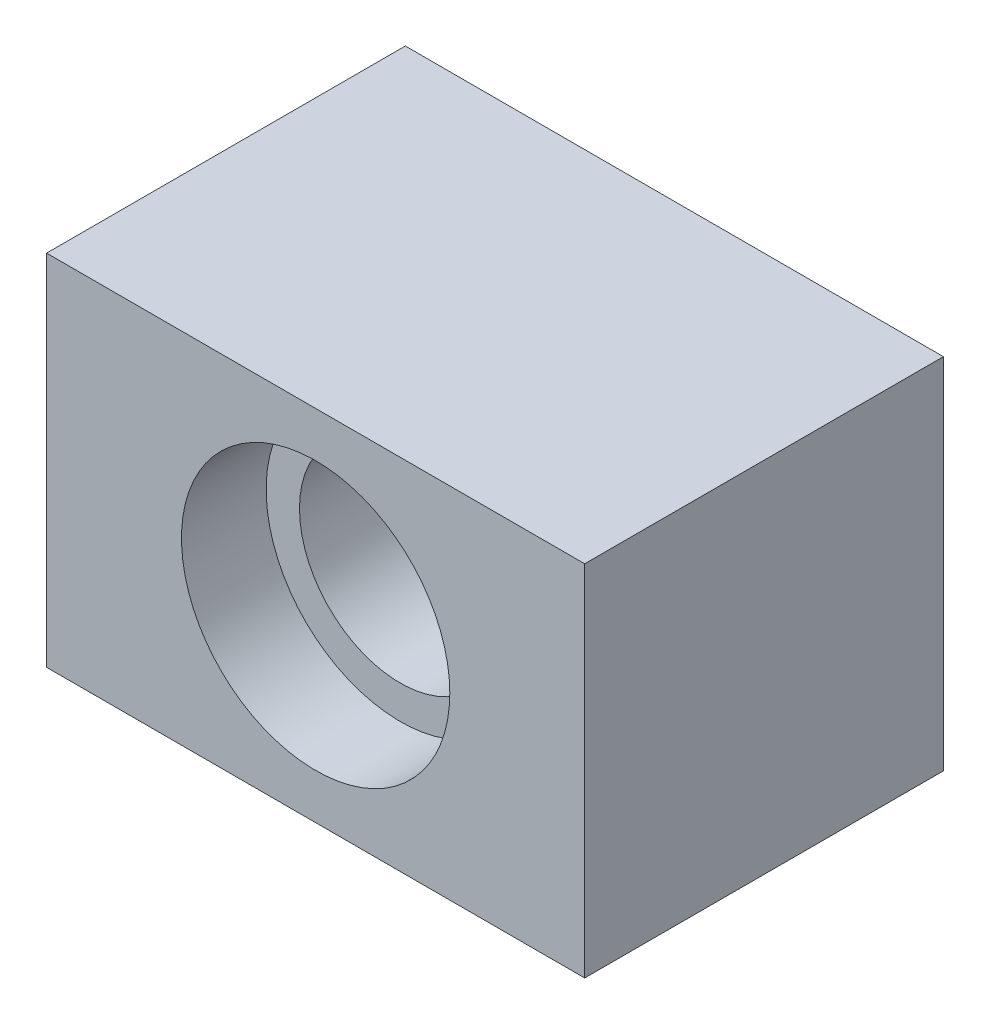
ISO-10303-21;
HEADER;
FILE_DESCRIPTION(('STEP AP214'),'2;1');
FILE_NAME('part.step','',(''),(''),'','','');
FILE_SCHEMA(('AUTOMOTIVE_DESIGN { 1 0 10303 214 1 1 1 1 }'));
ENDSEC;
DATA;
#1=APPLICATION_CONTEXT('core data for automotive mechanical design processes');
#2=APPLICATION_PROTOCOL_DEFINITION('international standard','automotive_design',2000,#1);
#3=PRODUCT_CONTEXT('',#1,'mechanical');
#4=PRODUCT('Part','Part','',(#3));
#5=PRODUCT_RELATED_PRODUCT_CATEGORY('part','',(#4));
#6=PRODUCT_DEFINITION_FORMATION('','',#4);
#7=PRODUCT_DEFINITION_CONTEXT('part definition',#1,'design');
#8=PRODUCT_DEFINITION('design','',#6,#7);
#9=PRODUCT_DEFINITION_SHAPE('','',#8);
#10=(LENGTH_UNIT() NAMED_UNIT(*) SI_UNIT(.MILLI.,.METRE.));
#11=(NAMED_UNIT(*) PLANE_ANGLE_UNIT() SI_UNIT($,.RADIAN.));
#12=(NAMED_UNIT(*) SI_UNIT($,.STERADIAN.) SOLID_ANGLE_UNIT());
#13=UNCERTAINTY_MEASURE_WITH_UNIT(LENGTH_MEASURE(1.E-05),#10,'distance_accuracy_value','');
#14=(GEOMETRIC_REPRESENTATION_CONTEXT(3) GLOBAL_UNCERTAINTY_ASSIGNED_CONTEXT((#13)) GLOBAL_UNIT_ASSIGNED_CONTEXT((#10,
#11,#12)) REPRESENTATION_CONTEXT('',''));
#15=CARTESIAN_POINT('',(0.,0.,0.));
#16=DIRECTION('',(0.,0.,1.));
#17=DIRECTION('',(1.,0.,0.));
#18=AXIS2_PLACEMENT_3D('',#15,#16,#17);
#19=CARTESIAN_POINT('',(0.,0.,-12.7));
#20=DIRECTION('',(0.,0.,1.));
#21=DIRECTION('',(1.,0.,0.));
#22=AXIS2_PLACEMENT_3D('',#19,#20,#21);
#23=PLANE('',#22);
#24=CARTESIAN_POINT('',(-14.2748,-6.35,-12.7));
#25=DIRECTION('',(0.,0.,1.));
#26=DIRECTION('',(1.,0.,0.));
#27=AXIS2_PLACEMENT_3D('',#24,#25,#26);
#28=CIRCLE('',#27,3.175);
#29=CARTESIAN_POINT('',(-11.0998,-6.35,-12.7));
#30=VERTEX_POINT('',#29);
#31=EDGE_CURVE('E116',#30,#30,#28,.F.);
#32=ORIENTED_EDGE('',*,*,#31,.F.);
#33=EDGE_LOOP('',(#32));
#34=FACE_BOUND('',#33,.T.);
#35=DIRECTION('',(0.,-1.,0.));
#36=VECTOR('',#35,1.);
#37=CARTESIAN_POINT('',(-19.05,12.7,-12.7));
#38=LINE('',#37,#36);
#39=CARTESIAN_POINT('',(-19.05,12.7,-12.7));
#40=VERTEX_POINT('',#39);
#41=CARTESIAN_POINT('',(-19.05,-12.7,-12.7));
#42=VERTEX_POINT('',#41);
#43=EDGE_CURVE('E100',#40,#42,#38,.T.);
#44=ORIENTED_EDGE('',*,*,#43,.F.);
#45=DIRECTION('',(-1.,0.,0.));
#46=VECTOR('',#45,1.);
#47=CARTESIAN_POINT('',(19.05,12.7,-12.7));
#48=LINE('',#47,#46);
#49=CARTESIAN_POINT('',(19.05,12.7,-12.7));
#50=VERTEX_POINT('',#49);
#51=EDGE_CURVE('E75',#50,#40,#48,.T.);
#52=ORIENTED_EDGE('',*,*,#51,.F.);
#53=DIRECTION('',(0.,1.,0.));
#54=VECTOR('',#53,1.);
#55=CARTESIAN_POINT('',(19.05,-12.7,-12.7));
#56=LINE('',#55,#54);
#57=CARTESIAN_POINT('',(19.05,-12.7,-12.7));
#58=VERTEX_POINT('',#57);
#59=EDGE_CURVE('E69',#58,#50,#56,.T.);
#60=ORIENTED_EDGE('',*,*,#59,.F.);
#61=DIRECTION('',(1.,0.,0.));
#62=VECTOR('',#61,1.);
#63=CARTESIAN_POINT('',(-19.05,-12.7,-12.7));
#64=LINE('',#63,#62);
#65=EDGE_CURVE('E91',#42,#58,#64,.T.);
#66=ORIENTED_EDGE('',*,*,#65,.F.);
#67=EDGE_LOOP('',(#44,#52,#60,#66));
#68=FACE_BOUND('',#67,.T.);
#69=CARTESIAN_POINT('',(0.,0.,-12.7));
#70=DIRECTION('',(0.,0.,1.));
#71=DIRECTION('',(1.,0.,0.));
#72=AXIS2_PLACEMENT_3D('',#69,#70,#71);
#73=CIRCLE('',#72,9.5);
#74=CARTESIAN_POINT('',(-9.5,0.,-12.7));
#75=VERTEX_POINT('',#74);
#76=EDGE_CURVE('E118',#75,#75,#73,.T.);
#77=ORIENTED_EDGE('',*,*,#76,.T.);
#78=EDGE_LOOP('',(#77));
#79=FACE_BOUND('',#78,.T.);
#80=CARTESIAN_POINT('',(14.2748,6.35,-12.7));
#81=DIRECTION('',(0.,0.,1.));
#82=DIRECTION('',(1.,0.,0.));
#83=AXIS2_PLACEMENT_3D('',#80,#81,#82);
#84=CIRCLE('',#83,3.175);
#85=CARTESIAN_POINT('',(17.4498,6.35,-12.7));
#86=VERTEX_POINT('',#85);
#87=EDGE_CURVE('E37',#86,#86,#84,.F.);
#88=ORIENTED_EDGE('',*,*,#87,.F.);
#89=EDGE_LOOP('',(#88));
#90=FACE_BOUND('',#89,.T.);
#91=ADVANCED_FACE('F33',(#34,#68,#79,#90),#23,.F.);
#92=CARTESIAN_POINT('',(0.,0.,12.7));
#93=DIRECTION('',(0.,0.,-1.));
#94=DIRECTION('',(-1.,0.,0.));
#95=AXIS2_PLACEMENT_3D('',#92,#93,#94);
#96=CYLINDRICAL_SURFACE('',#95,7.1374);
#97=CARTESIAN_POINT('',(0.,0.,-6.7056));
#98=DIRECTION('',(0.,0.,1.));
#99=DIRECTION('',(1.,0.,0.));
#100=AXIS2_PLACEMENT_3D('',#97,#98,#99);
#101=CIRCLE('',#100,7.1374);
#102=CARTESIAN_POINT('',(7.1374,0.,-6.7056));
#103=VERTEX_POINT('',#102);
#104=EDGE_CURVE('E112',#103,#103,#101,.T.);
#105=ORIENTED_EDGE('',*,*,#104,.F.);
#106=EDGE_LOOP('',(#105));
#107=FACE_BOUND('',#106,.T.);
#108=CARTESIAN_POINT('',(0.,0.,6.7056));
#109=DIRECTION('',(0.,0.,1.));
#110=DIRECTION('',(1.,0.,0.));
#111=AXIS2_PLACEMENT_3D('',#108,#109,#110);
#112=CIRCLE('',#111,7.1374);
#113=CARTESIAN_POINT('',(7.1374,0.,6.7056));
#114=VERTEX_POINT('',#113);
#115=EDGE_CURVE('E103',#114,#114,#112,.T.);
#116=ORIENTED_EDGE('',*,*,#115,.T.);
#117=EDGE_LOOP('',(#116));
#118=FACE_BOUND('',#117,.T.);
#119=ADVANCED_FACE('F142',(#107,#118),#96,.F.);
#120=CARTESIAN_POINT('',(0.,0.,12.7));
#121=DIRECTION('',(0.,0.,1.));
#122=DIRECTION('',(1.,0.,0.));
#123=AXIS2_PLACEMENT_3D('',#120,#121,#122);
#124=PLANE('',#123);
#125=CARTESIAN_POINT('',(0.,0.,12.7));
#126=DIRECTION('',(0.,0.,1.));
#127=DIRECTION('',(1.,0.,0.));
#128=AXIS2_PLACEMENT_3D('',#125,#126,#127);
#129=CIRCLE('',#128,9.5);
#130=CARTESIAN_POINT('',(9.5,0.,12.7));
#131=VERTEX_POINT('',#130);
#132=EDGE_CURVE('E114',#131,#131,#129,.T.);
#133=ORIENTED_EDGE('',*,*,#132,.F.);
#134=EDGE_LOOP('',(#133));
#135=FACE_BOUND('',#134,.T.);
#136=DIRECTION('',(0.,-1.,0.));
#137=VECTOR('',#136,1.);
#138=CARTESIAN_POINT('',(-19.05,12.7,12.7));
#139=LINE('',#138,#137);
#140=CARTESIAN_POINT('',(-19.05,12.7,12.7));
#141=VERTEX_POINT('',#140);
#142=CARTESIAN_POINT('',(-19.05,-12.7,12.7));
#143=VERTEX_POINT('',#142);
#144=EDGE_CURVE('E87',#141,#143,#139,.T.);
#145=ORIENTED_EDGE('',*,*,#144,.T.);
#146=DIRECTION('',(1.,0.,0.));
#147=VECTOR('',#146,1.);
#148=CARTESIAN_POINT('',(-19.05,-12.7,12.7));
#149=LINE('',#148,#147);
#150=CARTESIAN_POINT('',(19.05,-12.7,12.7));
#151=VERTEX_POINT('',#150);
#152=EDGE_CURVE('E82',#143,#151,#149,.T.);
#153=ORIENTED_EDGE('',*,*,#152,.T.);
#154=DIRECTION('',(0.,1.,0.));
#155=VECTOR('',#154,1.);
#156=CARTESIAN_POINT('',(19.05,-12.7,12.7));
#157=LINE('',#156,#155);
#158=CARTESIAN_POINT('',(19.05,12.7,12.7));
#159=VERTEX_POINT('',#158);
#160=EDGE_CURVE('E85',#151,#159,#157,.T.);
#161=ORIENTED_EDGE('',*,*,#160,.T.);
#162=DIRECTION('',(-1.,0.,0.));
#163=VECTOR('',#162,1.);
#164=CARTESIAN_POINT('',(19.05,12.7,12.7));
#165=LINE('',#164,#163);
#166=EDGE_CURVE('E52',#159,#141,#165,.T.);
#167=ORIENTED_EDGE('',*,*,#166,.T.);
#168=EDGE_LOOP('',(#145,#153,#161,#167));
#169=FACE_BOUND('',#168,.T.);
#170=ADVANCED_FACE('F83',(#135,#169),#124,.T.);
#171=CARTESIAN_POINT('',(-19.05,12.7,12.7));
#172=DIRECTION('',(1.,0.,0.));
#173=DIRECTION('',(0.,0.,-1.));
#174=AXIS2_PLACEMENT_3D('',#171,#172,#173);
#175=PLANE('',#174);
#176=ORIENTED_EDGE('',*,*,#43,.T.);
#177=DIRECTION('',(0.,0.,-1.));
#178=VECTOR('',#177,1.);
#179=CARTESIAN_POINT('',(-19.05,-12.7,12.7));
#180=LINE('',#179,#178);
#181=EDGE_CURVE('E11',#143,#42,#180,.T.);
#182=ORIENTED_EDGE('',*,*,#181,.F.);
#183=ORIENTED_EDGE('',*,*,#144,.F.);
#184=DIRECTION('',(0.,0.,-1.));
#185=VECTOR('',#184,1.);
#186=CARTESIAN_POINT('',(-19.05,12.7,12.7));
#187=LINE('',#186,#185);
#188=EDGE_CURVE('E96',#141,#40,#187,.T.);
#189=ORIENTED_EDGE('',*,*,#188,.T.);
#190=EDGE_LOOP('',(#176,#182,#183,#189));
#191=FACE_BOUND('',#190,.T.);
#192=ADVANCED_FACE('F35',(#191),#175,.F.);
#193=CARTESIAN_POINT('',(-19.05,-12.7,12.7));
#194=DIRECTION('',(0.,1.,0.));
#195=DIRECTION('',(0.,0.,1.));
#196=AXIS2_PLACEMENT_3D('',#193,#194,#195);
#197=PLANE('',#196);
#198=ORIENTED_EDGE('',*,*,#65,.T.);
#199=DIRECTION('',(0.,0.,-1.));
#200=VECTOR('',#199,1.);
#201=CARTESIAN_POINT('',(19.05,-12.7,12.7));
#202=LINE('',#201,#200);
#203=EDGE_CURVE('E43',#151,#58,#202,.T.);
#204=ORIENTED_EDGE('',*,*,#203,.F.);
#205=ORIENTED_EDGE('',*,*,#152,.F.);
#206=ORIENTED_EDGE('',*,*,#181,.T.);
#207=EDGE_LOOP('',(#198,#204,#205,#206));
#208=FACE_BOUND('',#207,.T.);
#209=ADVANCED_FACE('F90',(#208),#197,.F.);
#210=CARTESIAN_POINT('',(19.05,-12.7,12.7));
#211=DIRECTION('',(-1.,0.,0.));
#212=DIRECTION('',(0.,0.,1.));
#213=AXIS2_PLACEMENT_3D('',#210,#211,#212);
#214=PLANE('',#213);
#215=ORIENTED_EDGE('',*,*,#59,.T.);
#216=DIRECTION('',(0.,0.,-1.));
#217=VECTOR('',#216,1.);
#218=CARTESIAN_POINT('',(19.05,12.7,12.7));
#219=LINE('',#218,#217);
#220=EDGE_CURVE('E92',#159,#50,#219,.T.);
#221=ORIENTED_EDGE('',*,*,#220,.F.);
#222=ORIENTED_EDGE('',*,*,#160,.F.);
#223=ORIENTED_EDGE('',*,*,#203,.T.);
#224=EDGE_LOOP('',(#215,#221,#222,#223));
#225=FACE_BOUND('',#224,.T.);
#226=ADVANCED_FACE('F94',(#225),#214,.F.);
#227=CARTESIAN_POINT('',(19.05,12.7,12.7));
#228=DIRECTION('',(0.,-1.,0.));
#229=DIRECTION('',(1.,0.,0.));
#230=AXIS2_PLACEMENT_3D('',#227,#228,#229);
#231=PLANE('',#230);
#232=ORIENTED_EDGE('',*,*,#51,.T.);
#233=ORIENTED_EDGE('',*,*,#188,.F.);
#234=ORIENTED_EDGE('',*,*,#166,.F.);
#235=ORIENTED_EDGE('',*,*,#220,.T.);
#236=EDGE_LOOP('',(#232,#233,#234,#235));
#237=FACE_BOUND('',#236,.T.);
#238=ADVANCED_FACE('F158',(#237),#231,.F.);
#239=CARTESIAN_POINT('',(0.,0.,6.7056));
#240=DIRECTION('',(0.,0.,1.));
#241=DIRECTION('',(1.,0.,0.));
#242=AXIS2_PLACEMENT_3D('',#239,#240,#241);
#243=CYLINDRICAL_SURFACE('',#242,9.5);
#244=CARTESIAN_POINT('',(0.,0.,6.7056));
#245=DIRECTION('',(0.,0.,1.));
#246=DIRECTION('',(1.,0.,0.));
#247=AXIS2_PLACEMENT_3D('',#244,#245,#246);
#248=CIRCLE('',#247,9.5);
#249=CARTESIAN_POINT('',(9.5,0.,6.7056));
#250=VERTEX_POINT('',#249);
#251=EDGE_CURVE('E111',#250,#250,#248,.T.);
#252=CARTESIAN_POINT('',(9.5,0.,6.7056));
#253=CARTESIAN_POINT('',(9.5,0.,6.76804166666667));
#254=CARTESIAN_POINT('',(9.5,0.,6.83048333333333));
#255=CARTESIAN_POINT('',(9.5,0.,6.95536666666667));
#256=CARTESIAN_POINT('',(9.5,0.,7.01780833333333));
#257=CARTESIAN_POINT('',(9.5,0.,7.14269166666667));
#258=CARTESIAN_POINT('',(9.5,0.,7.20513333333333));
#259=CARTESIAN_POINT('',(9.5,0.,7.33001666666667));
#260=CARTESIAN_POINT('',(9.5,0.,7.39245833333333));
#261=CARTESIAN_POINT('',(9.5,0.,7.51734166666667));
#262=CARTESIAN_POINT('',(9.5,0.,7.57978333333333));
#263=CARTESIAN_POINT('',(9.5,0.,7.70466666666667));
#264=CARTESIAN_POINT('',(9.5,0.,7.76710833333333));
#265=CARTESIAN_POINT('',(9.5,0.,7.89199166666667));
#266=CARTESIAN_POINT('',(9.5,0.,7.95443333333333));
#267=CARTESIAN_POINT('',(9.5,0.,8.07931666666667));
#268=CARTESIAN_POINT('',(9.5,0.,8.14175833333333));
#269=CARTESIAN_POINT('',(9.5,0.,8.26664166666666));
#270=CARTESIAN_POINT('',(9.5,0.,8.32908333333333));
#271=CARTESIAN_POINT('',(9.5,0.,8.45396666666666));
#272=CARTESIAN_POINT('',(9.5,0.,8.51640833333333));
#273=CARTESIAN_POINT('',(9.5,0.,8.64129166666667));
#274=CARTESIAN_POINT('',(9.5,0.,8.70373333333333));
#275=CARTESIAN_POINT('',(9.5,0.,8.82861666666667));
#276=CARTESIAN_POINT('',(9.5,0.,8.89105833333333));
#277=CARTESIAN_POINT('',(9.5,0.,9.01594166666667));
#278=CARTESIAN_POINT('',(9.5,0.,9.07838333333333));
#279=CARTESIAN_POINT('',(9.5,0.,9.20326666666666));
#280=CARTESIAN_POINT('',(9.5,0.,9.26570833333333));
#281=CARTESIAN_POINT('',(9.5,0.,9.39059166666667));
#282=CARTESIAN_POINT('',(9.5,0.,9.45303333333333));
#283=CARTESIAN_POINT('',(9.5,0.,9.57791666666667));
#284=CARTESIAN_POINT('',(9.5,0.,9.64035833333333));
#285=CARTESIAN_POINT('',(9.5,0.,9.76524166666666));
#286=CARTESIAN_POINT('',(9.5,0.,9.82768333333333));
#287=CARTESIAN_POINT('',(9.5,0.,9.95256666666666));
#288=CARTESIAN_POINT('',(9.5,0.,10.0150083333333));
#289=CARTESIAN_POINT('',(9.5,0.,10.1398916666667));
#290=CARTESIAN_POINT('',(9.5,0.,10.2023333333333));
#291=CARTESIAN_POINT('',(9.5,0.,10.3272166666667));
#292=CARTESIAN_POINT('',(9.5,0.,10.3896583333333));
#293=CARTESIAN_POINT('',(9.5,0.,10.5145416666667));
#294=CARTESIAN_POINT('',(9.5,0.,10.5769833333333));
#295=CARTESIAN_POINT('',(9.5,0.,10.7018666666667));
#296=CARTESIAN_POINT('',(9.5,0.,10.7643083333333));
#297=CARTESIAN_POINT('',(9.5,0.,10.8891916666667));
#298=CARTESIAN_POINT('',(9.5,0.,10.9516333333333));
#299=CARTESIAN_POINT('',(9.5,0.,11.0765166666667));
#300=CARTESIAN_POINT('',(9.5,0.,11.1389583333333));
#301=CARTESIAN_POINT('',(9.5,0.,11.2638416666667));
#302=CARTESIAN_POINT('',(9.5,0.,11.3262833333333));
#303=CARTESIAN_POINT('',(9.5,0.,11.4511666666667));
#304=CARTESIAN_POINT('',(9.5,0.,11.5136083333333));
#305=CARTESIAN_POINT('',(9.5,0.,11.6384916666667));
#306=CARTESIAN_POINT('',(9.5,0.,11.7009333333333));
#307=CARTESIAN_POINT('',(9.5,0.,11.8258166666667));
#308=CARTESIAN_POINT('',(9.5,0.,11.8882583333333));
#309=CARTESIAN_POINT('',(9.5,0.,12.0131416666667));
#310=CARTESIAN_POINT('',(9.5,0.,12.0755833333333));
#311=CARTESIAN_POINT('',(9.5,0.,12.2004666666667));
#312=CARTESIAN_POINT('',(9.5,0.,12.2629083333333));
#313=CARTESIAN_POINT('',(9.5,0.,12.3877916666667));
#314=CARTESIAN_POINT('',(9.5,0.,12.4502333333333));
#315=CARTESIAN_POINT('',(9.5,0.,12.5751166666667));
#316=CARTESIAN_POINT('',(9.5,0.,12.6375583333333));
#317=CARTESIAN_POINT('',(9.5,0.,12.7));
#318=B_SPLINE_CURVE_WITH_KNOTS('',3,(#252,#253,#254,#255,#256,#257,#258,#259,#260,#261,#262,
#263,#264,#265,#266,#267,#268,#269,#270,#271,#272,#273,#274,#275,#276,#277,#278,#279,#280,#281,
#282,#283,#284,#285,#286,#287,#288,#289,#290,#291,#292,#293,#294,#295,#296,#297,#298,#299,#300,
#301,#302,#303,#304,#305,#306,#307,#308,#309,#310,#311,#312,#313,#314,#315,#316,#317),
.UNSPECIFIED.,.F.,.F.,(4,2,2,2,2,2,2,2,2,2,2,2,2,2,2,2,2,2,2,2,2,2,2,2,2,2,2,2,2,2,2,2,4),(0.,
0.187324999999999,0.37465,0.561974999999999,0.7493,0.936624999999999,1.12395,1.311275,1.4986,
1.685925,1.87325,2.060575,2.2479,2.435225,2.62255,2.809875,2.9972,3.184525,3.37185,3.559175,
3.7465,3.933825,4.12115,4.308475,4.4958,4.683125,4.87045,5.057775,5.2451,5.432425,5.61975,
5.807075,5.9944),.UNSPECIFIED.);
#319=EDGE_CURVE('BSEAM139',#250,#131,#318,.T.);
#320=ORIENTED_EDGE('',*,*,#251,.F.);
#321=ORIENTED_EDGE('',*,*,#132,.T.);
#322=ORIENTED_EDGE('',*,*,#319,.T.);
#323=ORIENTED_EDGE('',*,*,#319,.F.);
#324=EDGE_LOOP('',(#320,#322,#321,#323));
#325=FACE_BOUND('',#324,.T.);
#326=ADVANCED_FACE('F139',(#325),#243,.F.);
#327=CARTESIAN_POINT('',(0.,0.,6.7056));
#328=DIRECTION('',(0.,0.,1.));
#329=DIRECTION('',(1.,0.,0.));
#330=AXIS2_PLACEMENT_3D('',#327,#328,#329);
#331=PLANE('',#330);
#332=ORIENTED_EDGE('',*,*,#115,.F.);
#333=EDGE_LOOP('',(#332));
#334=FACE_BOUND('',#333,.T.);
#335=ORIENTED_EDGE('',*,*,#251,.T.);
#336=EDGE_LOOP('',(#335));
#337=FACE_BOUND('',#336,.T.);
#338=ADVANCED_FACE('F181',(#334,#337),#331,.T.);
#339=CARTESIAN_POINT('',(0.,0.,-6.7056));
#340=DIRECTION('',(0.,0.,-1.));
#341=DIRECTION('',(-1.,0.,0.));
#342=AXIS2_PLACEMENT_3D('',#339,#340,#341);
#343=CYLINDRICAL_SURFACE('',#342,9.5);
#344=CARTESIAN_POINT('',(0.,0.,-6.7056));
#345=DIRECTION('',(0.,0.,1.));
#346=DIRECTION('',(1.,0.,0.));
#347=AXIS2_PLACEMENT_3D('',#344,#345,#346);
#348=CIRCLE('',#347,9.5);
#349=CARTESIAN_POINT('',(-9.5,0.,-6.7056));
#350=VERTEX_POINT('',#349);
#351=EDGE_CURVE('E115',#350,#350,#348,.T.);
#352=CARTESIAN_POINT('',(-9.5,0.,-6.7056));
#353=CARTESIAN_POINT('',(-9.5,0.,-6.76804166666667));
#354=CARTESIAN_POINT('',(-9.5,0.,-6.83048333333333));
#355=CARTESIAN_POINT('',(-9.5,0.,-6.95536666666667));
#356=CARTESIAN_POINT('',(-9.5,0.,-7.01780833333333));
#357=CARTESIAN_POINT('',(-9.5,0.,-7.14269166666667));
#358=CARTESIAN_POINT('',(-9.5,0.,-7.20513333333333));
#359=CARTESIAN_POINT('',(-9.5,0.,-7.33001666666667));
#360=CARTESIAN_POINT('',(-9.5,0.,-7.39245833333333));
#361=CARTESIAN_POINT('',(-9.5,0.,-7.51734166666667));
#362=CARTESIAN_POINT('',(-9.5,0.,-7.57978333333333));
#363=CARTESIAN_POINT('',(-9.5,0.,-7.70466666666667));
#364=CARTESIAN_POINT('',(-9.5,0.,-7.76710833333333));
#365=CARTESIAN_POINT('',(-9.5,0.,-7.89199166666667));
#366=CARTESIAN_POINT('',(-9.5,0.,-7.95443333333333));
#367=CARTESIAN_POINT('',(-9.5,0.,-8.07931666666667));
#368=CARTESIAN_POINT('',(-9.5,0.,-8.14175833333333));
#369=CARTESIAN_POINT('',(-9.5,0.,-8.26664166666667));
#370=CARTESIAN_POINT('',(-9.5,0.,-8.32908333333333));
#371=CARTESIAN_POINT('',(-9.5,0.,-8.45396666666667));
#372=CARTESIAN_POINT('',(-9.5,0.,-8.51640833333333));
#373=CARTESIAN_POINT('',(-9.5,0.,-8.64129166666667));
#374=CARTESIAN_POINT('',(-9.5,0.,-8.70373333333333));
#375=CARTESIAN_POINT('',(-9.5,0.,-8.82861666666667));
#376=CARTESIAN_POINT('',(-9.5,0.,-8.89105833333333));
#377=CARTESIAN_POINT('',(-9.5,0.,-9.01594166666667));
#378=CARTESIAN_POINT('',(-9.5,0.,-9.07838333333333));
#379=CARTESIAN_POINT('',(-9.5,0.,-9.20326666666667));
#380=CARTESIAN_POINT('',(-9.5,0.,-9.26570833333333));
#381=CARTESIAN_POINT('',(-9.5,0.,-9.39059166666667));
#382=CARTESIAN_POINT('',(-9.5,0.,-9.45303333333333));
#383=CARTESIAN_POINT('',(-9.5,0.,-9.57791666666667));
#384=CARTESIAN_POINT('',(-9.5,0.,-9.64035833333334));
#385=CARTESIAN_POINT('',(-9.5,0.,-9.76524166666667));
#386=CARTESIAN_POINT('',(-9.5,0.,-9.82768333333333));
#387=CARTESIAN_POINT('',(-9.5,0.,-9.95256666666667));
#388=CARTESIAN_POINT('',(-9.5,0.,-10.0150083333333));
#389=CARTESIAN_POINT('',(-9.5,0.,-10.1398916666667));
#390=CARTESIAN_POINT('',(-9.5,0.,-10.2023333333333));
#391=CARTESIAN_POINT('',(-9.5,0.,-10.3272166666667));
#392=CARTESIAN_POINT('',(-9.5,0.,-10.3896583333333));
#393=CARTESIAN_POINT('',(-9.5,0.,-10.5145416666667));
#394=CARTESIAN_POINT('',(-9.5,0.,-10.5769833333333));
#395=CARTESIAN_POINT('',(-9.5,0.,-10.7018666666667));
#396=CARTESIAN_POINT('',(-9.5,0.,-10.7643083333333));
#397=CARTESIAN_POINT('',(-9.5,0.,-10.8891916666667));
#398=CARTESIAN_POINT('',(-9.5,0.,-10.9516333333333));
#399=CARTESIAN_POINT('',(-9.5,0.,-11.0765166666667));
#400=CARTESIAN_POINT('',(-9.5,0.,-11.1389583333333));
#401=CARTESIAN_POINT('',(-9.5,0.,-11.2638416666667));
#402=CARTESIAN_POINT('',(-9.5,0.,-11.3262833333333));
#403=CARTESIAN_POINT('',(-9.5,0.,-11.4511666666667));
#404=CARTESIAN_POINT('',(-9.5,0.,-11.5136083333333));
#405=CARTESIAN_POINT('',(-9.5,0.,-11.6384916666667));
#406=CARTESIAN_POINT('',(-9.5,0.,-11.7009333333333));
#407=CARTESIAN_POINT('',(-9.5,0.,-11.8258166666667));
#408=CARTESIAN_POINT('',(-9.5,0.,-11.8882583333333));
#409=CARTESIAN_POINT('',(-9.5,0.,-12.0131416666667));
#410=CARTESIAN_POINT('',(-9.5,0.,-12.0755833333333));
#411=CARTESIAN_POINT('',(-9.5,0.,-12.2004666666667));
#412=CARTESIAN_POINT('',(-9.5,0.,-12.2629083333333));
#413=CARTESIAN_POINT('',(-9.5,0.,-12.3877916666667));
#414=CARTESIAN_POINT('',(-9.5,0.,-12.4502333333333));
#415=CARTESIAN_POINT('',(-9.5,0.,-12.5751166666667));
#416=CARTESIAN_POINT('',(-9.5,0.,-12.6375583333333));
#417=CARTESIAN_POINT('',(-9.5,0.,-12.7));
#418=B_SPLINE_CURVE_WITH_KNOTS('',3,(#352,#353,#354,#355,#356,#357,#358,#359,#360,#361,#362,
#363,#364,#365,#366,#367,#368,#369,#370,#371,#372,#373,#374,#375,#376,#377,#378,#379,#380,#381,
#382,#383,#384,#385,#386,#387,#388,#389,#390,#391,#392,#393,#394,#395,#396,#397,#398,#399,#400,
#401,#402,#403,#404,#405,#406,#407,#408,#409,#410,#411,#412,#413,#414,#415,#416,#417),
.UNSPECIFIED.,.F.,.F.,(4,2,2,2,2,2,2,2,2,2,2,2,2,2,2,2,2,2,2,2,2,2,2,2,2,2,2,2,2,2,2,2,4),(0.,
0.187325,0.374650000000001,0.561975,0.749300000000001,0.936625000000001,1.12395,1.311275,1.4986,
1.685925,1.87325,2.060575,2.2479,2.435225,2.62255,2.809875,2.9972,3.184525,3.37185,3.559175,
3.7465,3.933825,4.12115,4.308475,4.4958,4.683125,4.87045,5.057775,5.2451,5.432425,5.61975,
5.807075,5.9944),.UNSPECIFIED.);
#419=EDGE_CURVE('BSEAM189',#350,#75,#418,.T.);
#420=ORIENTED_EDGE('',*,*,#351,.T.);
#421=ORIENTED_EDGE('',*,*,#76,.F.);
#422=ORIENTED_EDGE('',*,*,#419,.T.);
#423=ORIENTED_EDGE('',*,*,#419,.F.);
#424=EDGE_LOOP('',(#420,#422,#421,#423));
#425=FACE_BOUND('',#424,.T.);
#426=ADVANCED_FACE('F189',(#425),#343,.F.);
#427=CARTESIAN_POINT('',(0.,0.,-6.7056));
#428=DIRECTION('',(0.,0.,1.));
#429=DIRECTION('',(1.,0.,0.));
#430=AXIS2_PLACEMENT_3D('',#427,#428,#429);
#431=PLANE('',#430);
#432=ORIENTED_EDGE('',*,*,#104,.T.);
#433=EDGE_LOOP('',(#432));
#434=FACE_BOUND('',#433,.T.);
#435=ORIENTED_EDGE('',*,*,#351,.F.);
#436=EDGE_LOOP('',(#435));
#437=FACE_BOUND('',#436,.T.);
#438=ADVANCED_FACE('F198',(#434,#437),#431,.F.);
#439=CARTESIAN_POINT('',(-14.2748,-6.35,2.54));
#440=DIRECTION('',(0.,0.,-1.));
#441=DIRECTION('',(-1.,0.,0.));
#442=AXIS2_PLACEMENT_3D('',#439,#440,#441);
#443=CYLINDRICAL_SURFACE('',#442,3.175);
#444=CARTESIAN_POINT('',(-14.2748,-6.35,2.54));
#445=DIRECTION('',(0.,0.,1.));
#446=DIRECTION('',(1.,0.,0.));
#447=AXIS2_PLACEMENT_3D('',#444,#445,#446);
#448=CIRCLE('',#447,3.175);
#449=CARTESIAN_POINT('',(-11.0998,-6.35,2.54));
#450=VERTEX_POINT('',#449);
#451=EDGE_CURVE('E119',#450,#450,#448,.T.);
#452=ORIENTED_EDGE('',*,*,#451,.T.);
#453=EDGE_LOOP('',(#452));
#454=FACE_BOUND('',#453,.T.);
#455=ORIENTED_EDGE('',*,*,#31,.T.);
#456=EDGE_LOOP('',(#455));
#457=FACE_BOUND('',#456,.T.);
#458=ADVANCED_FACE('F206',(#454,#457),#443,.F.);
#459=CARTESIAN_POINT('',(-14.2748,-6.35,2.54));
#460=DIRECTION('',(0.,0.,1.));
#461=DIRECTION('',(1.,0.,0.));
#462=AXIS2_PLACEMENT_3D('',#459,#460,#461);
#463=PLANE('',#462);
#464=ORIENTED_EDGE('',*,*,#451,.F.);
#465=EDGE_LOOP('',(#464));
#466=FACE_BOUND('',#465,.T.);
#467=ADVANCED_FACE('F214',(#466),#463,.F.);
#468=CARTESIAN_POINT('',(14.2748,6.35,2.54));
#469=DIRECTION('',(0.,0.,-1.));
#470=DIRECTION('',(-1.,0.,0.));
#471=AXIS2_PLACEMENT_3D('',#468,#469,#470);
#472=CYLINDRICAL_SURFACE('',#471,3.175);
#473=CARTESIAN_POINT('',(14.2748,6.35,2.54));
#474=DIRECTION('',(0.,0.,1.));
#475=DIRECTION('',(1.,0.,0.));
#476=AXIS2_PLACEMENT_3D('',#473,#474,#475);
#477=CIRCLE('',#476,3.175);
#478=CARTESIAN_POINT('',(17.4498,6.35,2.54));
#479=VERTEX_POINT('',#478);
#480=EDGE_CURVE('E129',#479,#479,#477,.T.);
#481=ORIENTED_EDGE('',*,*,#480,.T.);
#482=EDGE_LOOP('',(#481));
#483=FACE_BOUND('',#482,.T.);
#484=ORIENTED_EDGE('',*,*,#87,.T.);
#485=EDGE_LOOP('',(#484));
#486=FACE_BOUND('',#485,.T.);
#487=ADVANCED_FACE('F221',(#483,#486),#472,.F.);
#488=CARTESIAN_POINT('',(14.2748,6.35,2.54));
#489=DIRECTION('',(0.,0.,1.));
#490=DIRECTION('',(1.,0.,0.));
#491=AXIS2_PLACEMENT_3D('',#488,#489,#490);
#492=PLANE('',#491);
#493=ORIENTED_EDGE('',*,*,#480,.F.);
#494=EDGE_LOOP('',(#493));
#495=FACE_BOUND('',#494,.T.);
#496=ADVANCED_FACE('F229',(#495),#492,.F.);
#497=CLOSED_SHELL('',(#91,#119,#170,#192,#209,#226,#238,#326,#338,#426,#438,#458,#467,#487,#496));
#498=MANIFOLD_SOLID_BREP('B2',#497);
#499=ADVANCED_BREP_SHAPE_REPRESENTATION('',(#18,#498),#14);
#500=SHAPE_DEFINITION_REPRESENTATION(#9,#499);
ENDSEC;
END-ISO-10303-21;
